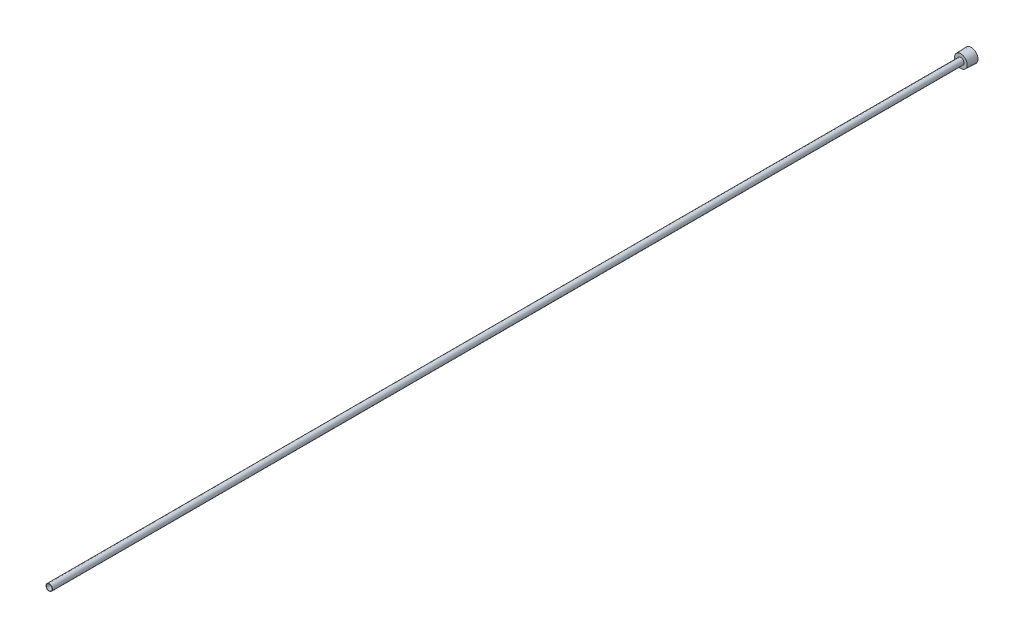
from build123d import *

# Parameters (mm, degrees)
SKETCH2_R          = 2.921
CUT_EXTRUDE1_DEPTH = 915.449359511
CUT_EXTRUDE2_DEPTH = 6.35


with BuildPart() as part:
    # Sketch1 → Revolve1 (revolve)
    with BuildSketch(Plane(origin=(0, 0, 0), x_dir=(0, 0, -1), z_dir=(1, 0, 0)), mode=Mode.PRIVATE) as revolve1_sk:
        Polygon((0, 0), (-914.4, 0), (-914.4, 3.175), (-10.3124, 3.175), (-10.3124, 6.342143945), (0, 6.7183), align=None)
    revolve(revolve1_sk.sketch.rotate(Axis((0, 0, 331.124179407), (0, 0, -1)), 90), axis=Axis((0, 0, 331.124179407), (0, 0, -1)))

    # Sketch2 → Cut-Extrude1 (cut, through all)
    with BuildSketch(Plane.XY.offset(914.4)):
        Circle(SKETCH2_R)
    extrude(amount=-CUT_EXTRUDE1_DEPTH, mode=Mode.SUBTRACT)

    # Sketch3 → Cut-Extrude2 (cut)
    with BuildSketch(Plane(origin=(0, 0, 0), x_dir=(-1, 0, 0), z_dir=(0, 0, -1))):
        Polygon((-3.175, -1.833087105), (0, -3.666174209), (3.175, -1.833087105), (3.175, 1.833087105), (0, 3.666174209), (-3.175, 1.833087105), align=None)
    extrude(amount=-CUT_EXTRUDE2_DEPTH, mode=Mode.SUBTRACT)


solid = part.part
